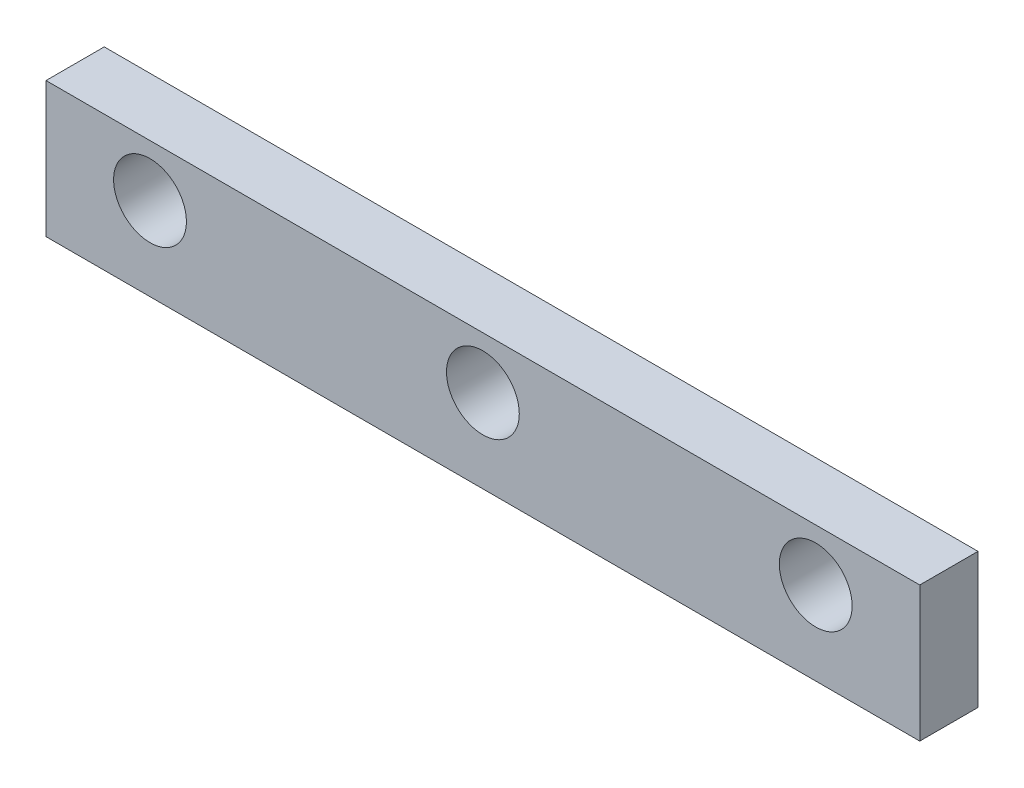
from build123d import *

# Parameters (mm, degrees)
ESQUISSE1_W        = 42
ESQUISSE1_H        = 6.5
ESQUISSE1_R        = 1.75
BOSS_EXTRU_1_DEPTH = 2.8


with BuildPart() as part:
    # Esquisse1 → Boss.-Extru.1 (new body)
    with BuildSketch(Plane.XY):
        with Locations((0, 3.25)):
            Rectangle(ESQUISSE1_W, ESQUISSE1_H)
        with Locations((-16, 4)):
            Circle(ESQUISSE1_R, mode=Mode.SUBTRACT)
        with Locations(Location((16, 4, 0), (0, 0, 180))):
            Circle(ESQUISSE1_R, mode=Mode.SUBTRACT)
        with Locations((0, 4)):
            Circle(ESQUISSE1_R, mode=Mode.SUBTRACT)
    extrude(amount=BOSS_EXTRU_1_DEPTH)


solid = part.part
